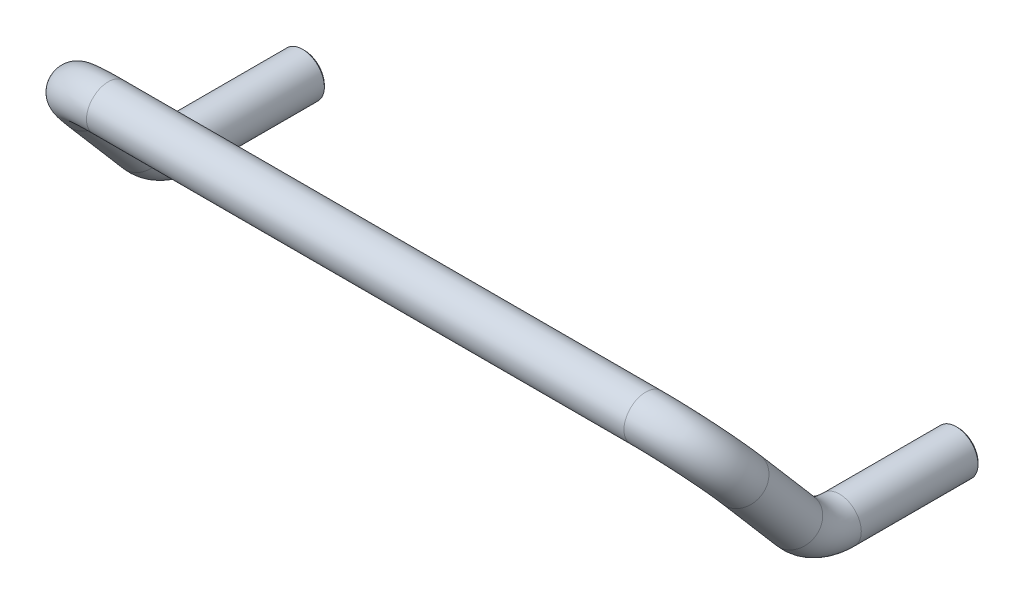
ISO-10303-21;
HEADER;
FILE_DESCRIPTION(('STEP AP214'),'2;1');
FILE_NAME('part.step','',(''),(''),'','','');
FILE_SCHEMA(('AUTOMOTIVE_DESIGN { 1 0 10303 214 1 1 1 1 }'));
ENDSEC;
DATA;
#1=APPLICATION_CONTEXT('core data for automotive mechanical design processes');
#2=APPLICATION_PROTOCOL_DEFINITION('international standard','automotive_design',2000,#1);
#3=PRODUCT_CONTEXT('',#1,'mechanical');
#4=PRODUCT('Part','Part','',(#3));
#5=PRODUCT_RELATED_PRODUCT_CATEGORY('part','',(#4));
#6=PRODUCT_DEFINITION_FORMATION('','',#4);
#7=PRODUCT_DEFINITION_CONTEXT('part definition',#1,'design');
#8=PRODUCT_DEFINITION('design','',#6,#7);
#9=PRODUCT_DEFINITION_SHAPE('','',#8);
#10=(LENGTH_UNIT() NAMED_UNIT(*) SI_UNIT(.MILLI.,.METRE.));
#11=(NAMED_UNIT(*) PLANE_ANGLE_UNIT() SI_UNIT($,.RADIAN.));
#12=(NAMED_UNIT(*) SI_UNIT($,.STERADIAN.) SOLID_ANGLE_UNIT());
#13=UNCERTAINTY_MEASURE_WITH_UNIT(LENGTH_MEASURE(1.E-05),#10,'distance_accuracy_value','');
#14=(GEOMETRIC_REPRESENTATION_CONTEXT(3) GLOBAL_UNCERTAINTY_ASSIGNED_CONTEXT((#13)) GLOBAL_UNIT_ASSIGNED_CONTEXT((#10,
#11,#12)) REPRESENTATION_CONTEXT('',''));
#15=CARTESIAN_POINT('',(0.,0.,0.));
#16=DIRECTION('',(0.,0.,1.));
#17=DIRECTION('',(1.,0.,0.));
#18=AXIS2_PLACEMENT_3D('',#15,#16,#17);
#19=CARTESIAN_POINT('',(0.,0.,0.));
#20=DIRECTION('',(0.,0.,-1.));
#21=DIRECTION('',(0.,1.,0.));
#22=AXIS2_PLACEMENT_3D('',#19,#20,#21);
#23=CONICAL_SURFACE('',#22,3.24999999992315,0.785398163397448);
#24=CARTESIAN_POINT('',(0.,0.,0.249999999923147));
#25=DIRECTION('',(0.,0.,-1.));
#26=DIRECTION('',(0.,1.,0.));
#27=AXIS2_PLACEMENT_3D('',#24,#25,#26);
#28=CIRCLE('',#27,3.);
#29=CARTESIAN_POINT('',(0.,3.,0.249999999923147));
#30=VERTEX_POINT('',#29);
#31=EDGE_CURVE('E15',#30,#30,#28,.F.);
#32=ORIENTED_EDGE('',*,*,#31,.T.);
#33=EDGE_LOOP('',(#32));
#34=FACE_BOUND('',#33,.T.);
#35=CARTESIAN_POINT('',(0.,0.,0.));
#36=DIRECTION('',(0.,0.,-1.));
#37=DIRECTION('',(0.,1.,0.));
#38=AXIS2_PLACEMENT_3D('',#35,#36,#37);
#39=CIRCLE('',#38,3.24999999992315);
#40=CARTESIAN_POINT('',(0.,3.24999999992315,0.));
#41=VERTEX_POINT('',#40);
#42=EDGE_CURVE('E131',#41,#41,#39,.T.);
#43=ORIENTED_EDGE('',*,*,#42,.T.);
#44=EDGE_LOOP('',(#43));
#45=FACE_BOUND('',#44,.T.);
#46=ADVANCED_FACE('F12',(#34,#45),#23,.F.);
#47=CARTESIAN_POINT('',(0.,0.,0.));
#48=DIRECTION('',(0.,0.,1.));
#49=DIRECTION('',(0.,-1.,0.));
#50=AXIS2_PLACEMENT_3D('',#47,#48,#49);
#51=PLANE('',#50);
#52=ORIENTED_EDGE('',*,*,#42,.F.);
#53=EDGE_LOOP('',(#52));
#54=FACE_BOUND('',#53,.T.);
#55=CARTESIAN_POINT('',(0.,0.,0.));
#56=DIRECTION('',(0.,0.,1.));
#57=DIRECTION('',(0.,-1.,0.));
#58=AXIS2_PLACEMENT_3D('',#55,#56,#57);
#59=CIRCLE('',#58,5.49999999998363);
#60=CARTESIAN_POINT('',(0.,-5.49999999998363,0.));
#61=VERTEX_POINT('',#60);
#62=EDGE_CURVE('E134',#61,#61,#59,.T.);
#63=ORIENTED_EDGE('',*,*,#62,.F.);
#64=EDGE_LOOP('',(#63));
#65=FACE_BOUND('',#64,.T.);
#66=ADVANCED_FACE('F47',(#54,#65),#51,.F.);
#67=CARTESIAN_POINT('',(0.,0.,0.499999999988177));
#68=DIRECTION('',(0.,0.,1.));
#69=DIRECTION('',(0.,-1.,0.));
#70=AXIS2_PLACEMENT_3D('',#67,#68,#69);
#71=CONICAL_SURFACE('',#70,5.99999999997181,0.785398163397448);
#72=ORIENTED_EDGE('',*,*,#62,.T.);
#73=EDGE_LOOP('',(#72));
#74=FACE_BOUND('',#73,.T.);
#75=CARTESIAN_POINT('',(0.,0.,0.499999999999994));
#76=DIRECTION('',(0.,0.,1.));
#77=DIRECTION('',(0.,-1.,0.));
#78=AXIS2_PLACEMENT_3D('',#75,#76,#77);
#79=CIRCLE('',#78,6.);
#80=CARTESIAN_POINT('',(0.,-6.,0.499999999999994));
#81=VERTEX_POINT('',#80);
#82=EDGE_CURVE('E137',#81,#81,#79,.T.);
#83=ORIENTED_EDGE('',*,*,#82,.F.);
#84=EDGE_LOOP('',(#83));
#85=FACE_BOUND('',#84,.T.);
#86=ADVANCED_FACE('F44',(#74,#85),#71,.T.);
#87=CARTESIAN_POINT('',(0.,0.,32.6410412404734));
#88=DIRECTION('',(0.,0.,1.));
#89=DIRECTION('',(0.,-1.,0.));
#90=AXIS2_PLACEMENT_3D('',#87,#88,#89);
#91=CYLINDRICAL_SURFACE('',#90,6.);
#92=CARTESIAN_POINT('',(0.,0.,32.6410412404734));
#93=DIRECTION('',(0.,0.,1.));
#94=DIRECTION('',(0.,-1.,0.));
#95=AXIS2_PLACEMENT_3D('',#92,#93,#94);
#96=CIRCLE('',#95,6.);
#97=CARTESIAN_POINT('',(0.,-6.,32.6410412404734));
#98=VERTEX_POINT('',#97);
#99=EDGE_CURVE('E24',#98,#98,#96,.T.);
#100=ORIENTED_EDGE('',*,*,#99,.F.);
#101=EDGE_LOOP('',(#100));
#102=FACE_BOUND('',#101,.T.);
#103=ORIENTED_EDGE('',*,*,#82,.T.);
#104=EDGE_LOOP('',(#103));
#105=FACE_BOUND('',#104,.T.);
#106=ADVANCED_FACE('F39',(#102,#105),#91,.T.);
#107=CARTESIAN_POINT('',(0.,16.,32.6410412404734));
#108=DIRECTION('',(-1.,0.,0.));
#109=DIRECTION('',(0.,-1.,0.));
#110=AXIS2_PLACEMENT_3D('',#107,#108,#109);
#111=TOROIDAL_SURFACE('',#110,16.,6.);
#112=ORIENTED_EDGE('',*,*,#99,.T.);
#113=EDGE_LOOP('',(#112));
#114=FACE_BOUND('',#113,.T.);
#115=CARTESIAN_POINT('',(0.,5.58733802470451,44.7891468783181));
#116=DIRECTION('',(0.,-0.759256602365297,-0.650791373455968));
#117=DIRECTION('',(0.,0.650791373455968,-0.759256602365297));
#118=AXIS2_PLACEMENT_3D('',#115,#116,#117);
#119=CIRCLE('',#118,6.);
#120=CARTESIAN_POINT('',(0.,9.49208626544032,40.2336072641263));
#121=VERTEX_POINT('',#120);
#122=EDGE_CURVE('E19',#121,#121,#119,.F.);
#123=ORIENTED_EDGE('',*,*,#122,.F.);
#124=EDGE_LOOP('',(#123));
#125=FACE_BOUND('',#124,.T.);
#126=ADVANCED_FACE('F34',(#114,#125),#111,.T.);
#127=CARTESIAN_POINT('',(0.,5.58733802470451,44.7891468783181));
#128=DIRECTION('',(0.,-0.759256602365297,-0.650791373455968));
#129=DIRECTION('',(0.,0.650791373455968,-0.759256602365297));
#130=AXIS2_PLACEMENT_3D('',#127,#128,#129);
#131=CYLINDRICAL_SURFACE('',#130,6.);
#132=ORIENTED_EDGE('',*,*,#122,.T.);
#133=EDGE_LOOP('',(#132));
#134=FACE_BOUND('',#133,.T.);
#135=CARTESIAN_POINT('',(0.,22.8518943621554,59.5873380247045));
#136=DIRECTION('',(0.,0.759256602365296,0.650791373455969));
#137=DIRECTION('',(-1.,0.,0.));
#138=AXIS2_PLACEMENT_3D('',#135,#136,#137);
#139=CIRCLE('',#138,6.);
#140=CARTESIAN_POINT('',(-6.,22.8518943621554,59.5873380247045));
#141=VERTEX_POINT('',#140);
#142=EDGE_CURVE('E8',#141,#141,#139,.T.);
#143=ORIENTED_EDGE('',*,*,#142,.F.);
#144=EDGE_LOOP('',(#143));
#145=FACE_BOUND('',#144,.T.);
#146=ADVANCED_FACE('F38',(#134,#145),#131,.T.);
#147=CARTESIAN_POINT('',(16.,22.8518943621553,59.5873380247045));
#148=DIRECTION('',(0.,0.650791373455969,-0.759256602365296));
#149=DIRECTION('',(0.,0.759256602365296,0.650791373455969));
#150=AXIS2_PLACEMENT_3D('',#147,#148,#149);
#151=TOROIDAL_SURFACE('',#150,16.,6.);
#152=ORIENTED_EDGE('',*,*,#142,.T.);
#153=EDGE_LOOP('',(#152));
#154=FACE_BOUND('',#153,.T.);
#155=CARTESIAN_POINT('',(16.,35.,70.));
#156=DIRECTION('',(1.,0.,0.));
#157=DIRECTION('',(0.,0.,-1.));
#158=AXIS2_PLACEMENT_3D('',#155,#156,#157);
#159=CIRCLE('',#158,6.);
#160=CARTESIAN_POINT('',(16.,35.,64.));
#161=VERTEX_POINT('',#160);
#162=EDGE_CURVE('E124',#161,#161,#159,.F.);
#163=ORIENTED_EDGE('',*,*,#162,.T.);
#164=EDGE_LOOP('',(#163));
#165=FACE_BOUND('',#164,.T.);
#166=ADVANCED_FACE('F59',(#154,#165),#151,.T.);
#167=CARTESIAN_POINT('',(0.,0.,12.));
#168=DIRECTION('',(0.,0.,-1.));
#169=DIRECTION('',(0.,1.,0.));
#170=AXIS2_PLACEMENT_3D('',#167,#168,#169);
#171=PLANE('',#170);
#172=CARTESIAN_POINT('',(0.,0.,12.));
#173=DIRECTION('',(0.,0.,-1.));
#174=DIRECTION('',(0.,1.,0.));
#175=AXIS2_PLACEMENT_3D('',#172,#173,#174);
#176=CIRCLE('',#175,3.);
#177=CARTESIAN_POINT('',(0.,3.,12.));
#178=VERTEX_POINT('',#177);
#179=EDGE_CURVE('E126',#178,#178,#176,.T.);
#180=ORIENTED_EDGE('',*,*,#179,.T.);
#181=EDGE_LOOP('',(#180));
#182=FACE_BOUND('',#181,.T.);
#183=ADVANCED_FACE('F56',(#182),#171,.T.);
#184=CARTESIAN_POINT('',(0.,0.,12.));
#185=DIRECTION('',(0.,0.,-1.));
#186=DIRECTION('',(0.,1.,0.));
#187=AXIS2_PLACEMENT_3D('',#184,#185,#186);
#188=CYLINDRICAL_SURFACE('',#187,3.);
#189=ORIENTED_EDGE('',*,*,#179,.F.);
#190=EDGE_LOOP('',(#189));
#191=FACE_BOUND('',#190,.T.);
#192=ORIENTED_EDGE('',*,*,#31,.F.);
#193=EDGE_LOOP('',(#192));
#194=FACE_BOUND('',#193,.T.);
#195=ADVANCED_FACE('F65',(#191,#194),#188,.F.);
#196=CARTESIAN_POINT('',(90.,35.,70.));
#197=DIRECTION('',(-1.,0.,0.));
#198=DIRECTION('',(0.,0.,1.));
#199=AXIS2_PLACEMENT_3D('',#196,#197,#198);
#200=CYLINDRICAL_SURFACE('',#199,6.);
#201=ORIENTED_EDGE('',*,*,#162,.F.);
#202=EDGE_LOOP('',(#201));
#203=FACE_BOUND('',#202,.T.);
#204=CARTESIAN_POINT('',(164.,35.,70.));
#205=DIRECTION('',(1.,0.,0.));
#206=DIRECTION('',(0.,0.,-1.));
#207=AXIS2_PLACEMENT_3D('',#204,#205,#206);
#208=CIRCLE('',#207,6.);
#209=CARTESIAN_POINT('',(164.,35.,64.));
#210=VERTEX_POINT('',#209);
#211=EDGE_CURVE('E176',#210,#210,#208,.F.);
#212=ORIENTED_EDGE('',*,*,#211,.T.);
#213=EDGE_LOOP('',(#212));
#214=FACE_BOUND('',#213,.T.);
#215=ADVANCED_FACE('F72',(#203,#214),#200,.T.);
#216=CARTESIAN_POINT('',(180.,0.,0.));
#217=DIRECTION('',(0.,0.,-1.));
#218=DIRECTION('',(0.,1.,0.));
#219=AXIS2_PLACEMENT_3D('',#216,#217,#218);
#220=CONICAL_SURFACE('',#219,3.24999999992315,0.785398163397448);
#221=CARTESIAN_POINT('',(180.,0.,0.249999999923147));
#222=DIRECTION('',(0.,0.,1.));
#223=DIRECTION('',(0.,1.,0.));
#224=AXIS2_PLACEMENT_3D('',#221,#222,#223);
#225=CIRCLE('',#224,3.);
#226=CARTESIAN_POINT('',(180.,3.,0.249999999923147));
#227=VERTEX_POINT('',#226);
#228=EDGE_CURVE('E120',#227,#227,#225,.F.);
#229=ORIENTED_EDGE('',*,*,#228,.F.);
#230=EDGE_LOOP('',(#229));
#231=FACE_BOUND('',#230,.T.);
#232=CARTESIAN_POINT('',(180.,0.,0.));
#233=DIRECTION('',(0.,0.,1.));
#234=DIRECTION('',(0.,1.,0.));
#235=AXIS2_PLACEMENT_3D('',#232,#233,#234);
#236=CIRCLE('',#235,3.24999999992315);
#237=CARTESIAN_POINT('',(180.,3.24999999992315,0.));
#238=VERTEX_POINT('',#237);
#239=EDGE_CURVE('E117',#238,#238,#236,.T.);
#240=ORIENTED_EDGE('',*,*,#239,.F.);
#241=EDGE_LOOP('',(#240));
#242=FACE_BOUND('',#241,.T.);
#243=ADVANCED_FACE('F77',(#231,#242),#220,.F.);
#244=CARTESIAN_POINT('',(180.,0.,0.));
#245=DIRECTION('',(0.,0.,1.));
#246=DIRECTION('',(0.,-1.,0.));
#247=AXIS2_PLACEMENT_3D('',#244,#245,#246);
#248=PLANE('',#247);
#249=ORIENTED_EDGE('',*,*,#239,.T.);
#250=EDGE_LOOP('',(#249));
#251=FACE_BOUND('',#250,.T.);
#252=CARTESIAN_POINT('',(180.,0.,0.));
#253=DIRECTION('',(0.,0.,-1.));
#254=DIRECTION('',(0.,-1.,0.));
#255=AXIS2_PLACEMENT_3D('',#252,#253,#254);
#256=CIRCLE('',#255,5.49999999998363);
#257=CARTESIAN_POINT('',(180.,-5.49999999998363,0.));
#258=VERTEX_POINT('',#257);
#259=EDGE_CURVE('E112',#258,#258,#256,.T.);
#260=ORIENTED_EDGE('',*,*,#259,.T.);
#261=EDGE_LOOP('',(#260));
#262=FACE_BOUND('',#261,.T.);
#263=ADVANCED_FACE('F81',(#251,#262),#248,.F.);
#264=CARTESIAN_POINT('',(180.,0.,0.499999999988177));
#265=DIRECTION('',(0.,0.,1.));
#266=DIRECTION('',(0.,-1.,0.));
#267=AXIS2_PLACEMENT_3D('',#264,#265,#266);
#268=CONICAL_SURFACE('',#267,5.99999999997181,0.785398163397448);
#269=ORIENTED_EDGE('',*,*,#259,.F.);
#270=EDGE_LOOP('',(#269));
#271=FACE_BOUND('',#270,.T.);
#272=CARTESIAN_POINT('',(180.,0.,0.499999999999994));
#273=DIRECTION('',(0.,0.,-1.));
#274=DIRECTION('',(0.,-1.,0.));
#275=AXIS2_PLACEMENT_3D('',#272,#273,#274);
#276=CIRCLE('',#275,6.);
#277=CARTESIAN_POINT('',(180.,-6.,0.499999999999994));
#278=VERTEX_POINT('',#277);
#279=EDGE_CURVE('E109',#278,#278,#276,.T.);
#280=ORIENTED_EDGE('',*,*,#279,.T.);
#281=EDGE_LOOP('',(#280));
#282=FACE_BOUND('',#281,.T.);
#283=ADVANCED_FACE('F85',(#271,#282),#268,.T.);
#284=CARTESIAN_POINT('',(180.,0.,32.6410412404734));
#285=DIRECTION('',(0.,0.,1.));
#286=DIRECTION('',(0.,-1.,0.));
#287=AXIS2_PLACEMENT_3D('',#284,#285,#286);
#288=CYLINDRICAL_SURFACE('',#287,6.);
#289=CARTESIAN_POINT('',(180.,0.,32.6410412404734));
#290=DIRECTION('',(0.,0.,-1.));
#291=DIRECTION('',(0.,-1.,0.));
#292=AXIS2_PLACEMENT_3D('',#289,#290,#291);
#293=CIRCLE('',#292,6.);
#294=CARTESIAN_POINT('',(180.,-6.,32.6410412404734));
#295=VERTEX_POINT('',#294);
#296=EDGE_CURVE('E106',#295,#295,#293,.T.);
#297=ORIENTED_EDGE('',*,*,#296,.T.);
#298=EDGE_LOOP('',(#297));
#299=FACE_BOUND('',#298,.T.);
#300=ORIENTED_EDGE('',*,*,#279,.F.);
#301=EDGE_LOOP('',(#300));
#302=FACE_BOUND('',#301,.T.);
#303=ADVANCED_FACE('F89',(#299,#302),#288,.T.);
#304=CARTESIAN_POINT('',(180.,16.,32.6410412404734));
#305=DIRECTION('',(1.,0.,0.));
#306=DIRECTION('',(0.,-1.,0.));
#307=AXIS2_PLACEMENT_3D('',#304,#305,#306);
#308=TOROIDAL_SURFACE('',#307,16.,6.);
#309=ORIENTED_EDGE('',*,*,#296,.F.);
#310=EDGE_LOOP('',(#309));
#311=FACE_BOUND('',#310,.T.);
#312=CARTESIAN_POINT('',(180.,5.58733802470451,44.7891468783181));
#313=DIRECTION('',(0.,0.759256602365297,0.650791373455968));
#314=DIRECTION('',(0.,0.650791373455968,-0.759256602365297));
#315=AXIS2_PLACEMENT_3D('',#312,#313,#314);
#316=CIRCLE('',#315,6.);
#317=CARTESIAN_POINT('',(180.,9.49208626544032,40.2336072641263));
#318=VERTEX_POINT('',#317);
#319=EDGE_CURVE('E104',#318,#318,#316,.F.);
#320=ORIENTED_EDGE('',*,*,#319,.T.);
#321=EDGE_LOOP('',(#320));
#322=FACE_BOUND('',#321,.T.);
#323=ADVANCED_FACE('F93',(#311,#322),#308,.T.);
#324=CARTESIAN_POINT('',(180.,5.58733802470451,44.7891468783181));
#325=DIRECTION('',(0.,-0.759256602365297,-0.650791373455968));
#326=DIRECTION('',(0.,0.650791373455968,-0.759256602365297));
#327=AXIS2_PLACEMENT_3D('',#324,#325,#326);
#328=CYLINDRICAL_SURFACE('',#327,6.);
#329=ORIENTED_EDGE('',*,*,#319,.F.);
#330=EDGE_LOOP('',(#329));
#331=FACE_BOUND('',#330,.T.);
#332=CARTESIAN_POINT('',(180.,22.8518943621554,59.5873380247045));
#333=DIRECTION('',(0.,-0.759256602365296,-0.650791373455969));
#334=DIRECTION('',(1.,0.,0.));
#335=AXIS2_PLACEMENT_3D('',#332,#333,#334);
#336=CIRCLE('',#335,6.);
#337=CARTESIAN_POINT('',(186.,22.8518943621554,59.5873380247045));
#338=VERTEX_POINT('',#337);
#339=EDGE_CURVE('E127',#338,#338,#336,.T.);
#340=ORIENTED_EDGE('',*,*,#339,.T.);
#341=EDGE_LOOP('',(#340));
#342=FACE_BOUND('',#341,.T.);
#343=ADVANCED_FACE('F98',(#331,#342),#328,.T.);
#344=CARTESIAN_POINT('',(164.,22.8518943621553,59.5873380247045));
#345=DIRECTION('',(0.,0.650791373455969,-0.759256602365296));
#346=DIRECTION('',(0.,0.759256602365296,0.650791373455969));
#347=AXIS2_PLACEMENT_3D('',#344,#345,#346);
#348=TOROIDAL_SURFACE('',#347,16.,6.);
#349=ORIENTED_EDGE('',*,*,#339,.F.);
#350=EDGE_LOOP('',(#349));
#351=FACE_BOUND('',#350,.T.);
#352=ORIENTED_EDGE('',*,*,#211,.F.);
#353=EDGE_LOOP('',(#352));
#354=FACE_BOUND('',#353,.T.);
#355=ADVANCED_FACE('F161',(#351,#354),#348,.T.);
#356=CARTESIAN_POINT('',(180.,0.,12.));
#357=DIRECTION('',(0.,0.,-1.));
#358=DIRECTION('',(0.,1.,0.));
#359=AXIS2_PLACEMENT_3D('',#356,#357,#358);
#360=PLANE('',#359);
#361=CARTESIAN_POINT('',(180.,0.,12.));
#362=DIRECTION('',(0.,0.,1.));
#363=DIRECTION('',(0.,1.,0.));
#364=AXIS2_PLACEMENT_3D('',#361,#362,#363);
#365=CIRCLE('',#364,3.);
#366=CARTESIAN_POINT('',(180.,3.,12.));
#367=VERTEX_POINT('',#366);
#368=EDGE_CURVE('E123',#367,#367,#365,.T.);
#369=ORIENTED_EDGE('',*,*,#368,.F.);
#370=EDGE_LOOP('',(#369));
#371=FACE_BOUND('',#370,.T.);
#372=ADVANCED_FACE('F164',(#371),#360,.T.);
#373=CARTESIAN_POINT('',(180.,0.,12.));
#374=DIRECTION('',(0.,0.,-1.));
#375=DIRECTION('',(0.,1.,0.));
#376=AXIS2_PLACEMENT_3D('',#373,#374,#375);
#377=CYLINDRICAL_SURFACE('',#376,3.);
#378=ORIENTED_EDGE('',*,*,#368,.T.);
#379=EDGE_LOOP('',(#378));
#380=FACE_BOUND('',#379,.T.);
#381=ORIENTED_EDGE('',*,*,#228,.T.);
#382=EDGE_LOOP('',(#381));
#383=FACE_BOUND('',#382,.T.);
#384=ADVANCED_FACE('F166',(#380,#383),#377,.F.);
#385=CLOSED_SHELL('',(#46,#66,#86,#106,#126,#146,#166,#183,#195,#215,#243,#263,#283,#303,#323,
#343,#355,#372,#384));
#386=MANIFOLD_SOLID_BREP('B1',#385);
#387=ADVANCED_BREP_SHAPE_REPRESENTATION('',(#18,#386),#14);
#388=SHAPE_DEFINITION_REPRESENTATION(#9,#387);
ENDSEC;
END-ISO-10303-21;
